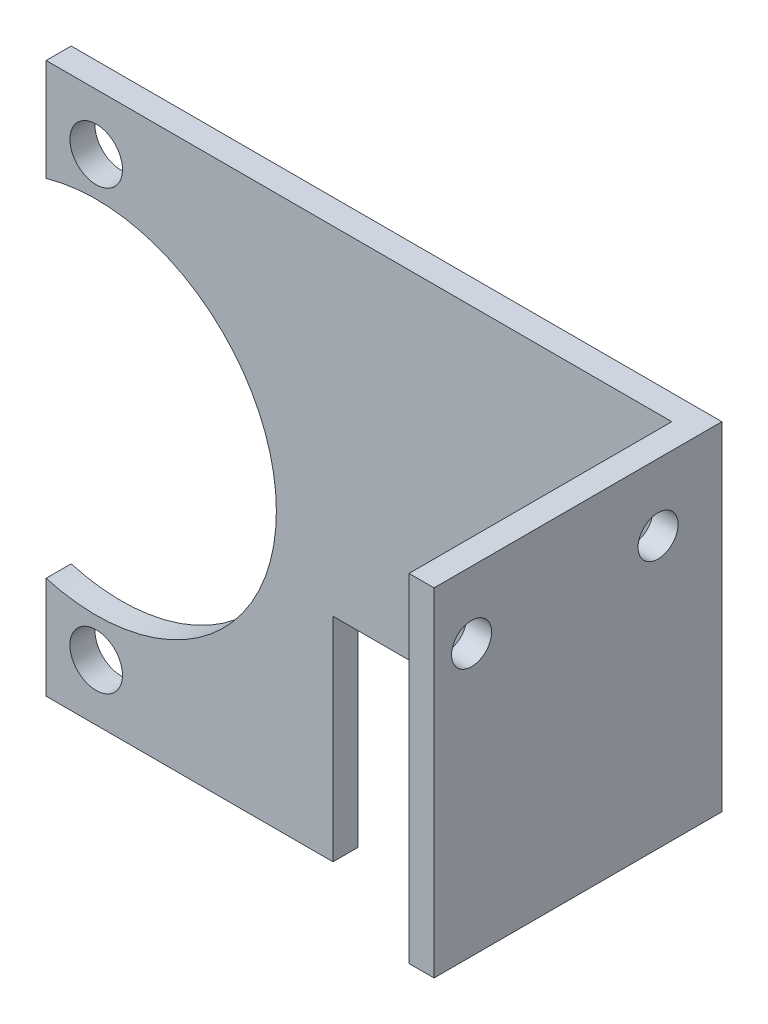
from build123d import *

# Parameters (mm, degrees)
ESQUISSE1_R             = 2.1
ESQUISSE1_W             = 27.077667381
ESQUISSE1_H             = 27
ESQUISSE1_W_2           = 2
BOSS_EXTRU_1_DEPTH      = 2
ESQUISSE1_3_W           = 2
ESQUISSE1_3_H           = 27
BOSS_EXTRU_2_DEPTH      = 23
ESQUISSE2_R             = 1.6
ENL_V_MAT_EXTRU_1_DEPTH = 47.938789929


with BuildPart() as part:
    # Esquisse1 → Boss.-Extru.1 (new body)
    # profile 1 of 4: a face of its own
    with BuildSketch(Plane.XY):
        with BuildLine():
            Line((-11.577667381, 22), (-34.5, 22))
            Line((-34.5, 22), (-34.5, 13.833293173))
            ThreePointArc((-34.5, 13.833293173), (-16.1, 0), (-34.5, -13.833293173))
            Line((-34.5, -13.833293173), (-34.5, -22))
            Line((-34.5, -22), (-11.577667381, -22))
            Line((-11.577667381, -22), (-11.577667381, -5))
            Line((-11.577667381, -5), (-11.577667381, 22))
        make_face()
        with Locations((-30.5, -17.5)):
            Circle(ESQUISSE1_R, mode=Mode.SUBTRACT)
        with Locations((-30.5, 17.5)):
            Circle(ESQUISSE1_R, mode=Mode.SUBTRACT)
    # profile 2 of 4: a face of its own
    with BuildSketch(Plane.XY):
        with Locations((1.96116631, 8.5)):
            Rectangle(ESQUISSE1_W, ESQUISSE1_H)
    # profile 3 of 4: a face of its own
    with BuildSketch(Plane.XY):
        with Locations((16.5, 8.5)):
            Rectangle(ESQUISSE1_W_2, ESQUISSE1_H)
    # profile 4 of 4: a face of its own
    with BuildSketch(Plane.XY):
        with Locations((16.5, 8.5)):
            Rectangle(ESQUISSE1_W_2, ESQUISSE1_H)
    extrude(amount=BOSS_EXTRU_1_DEPTH)

    # Esquisse1_3 → Boss.-Extru.2 (add)
    with BuildSketch(Plane.XY):
        with Locations((16.5, 8.5)):
            Rectangle(ESQUISSE1_3_W, ESQUISSE1_3_H)
    extrude(amount=BOSS_EXTRU_2_DEPTH)

    # Esquisse2 → Enl_v. mat.-Extru.1 (cut, through all)
    with BuildSketch(Plane(origin=(0, 0, 0), x_dir=(0, 0, -1), z_dir=(1, 0, 0))):
        with Locations(Location((-20, 16.65, 0), (0, 0, 90))):
            Circle(ESQUISSE2_R)
        with Locations(Location((-5.1, 16.65, 0), (0, 0, 90))):
            Circle(ESQUISSE2_R)
    extrude(amount=ENL_V_MAT_EXTRU_1_DEPTH, mode=Mode.SUBTRACT)


solid = part.part
